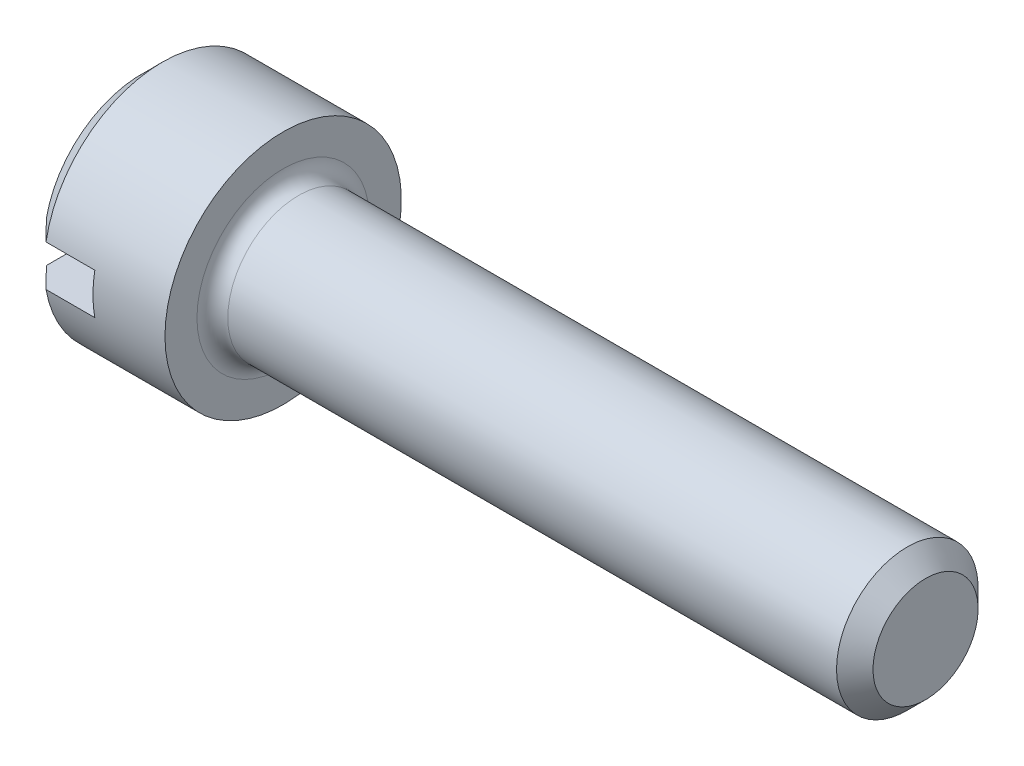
ISO-10303-21;
HEADER;
FILE_DESCRIPTION(('STEP AP214'),'2;1');
FILE_NAME('part.step','',(''),(''),'','','');
FILE_SCHEMA(('AUTOMOTIVE_DESIGN { 1 0 10303 214 1 1 1 1 }'));
ENDSEC;
DATA;
#1=APPLICATION_CONTEXT('core data for automotive mechanical design processes');
#2=APPLICATION_PROTOCOL_DEFINITION('international standard','automotive_design',2000,#1);
#3=PRODUCT_CONTEXT('',#1,'mechanical');
#4=PRODUCT('Part','Part','',(#3));
#5=PRODUCT_RELATED_PRODUCT_CATEGORY('part','',(#4));
#6=PRODUCT_DEFINITION_FORMATION('','',#4);
#7=PRODUCT_DEFINITION_CONTEXT('part definition',#1,'design');
#8=PRODUCT_DEFINITION('design','',#6,#7);
#9=PRODUCT_DEFINITION_SHAPE('','',#8);
#10=(LENGTH_UNIT() NAMED_UNIT(*) SI_UNIT(.MILLI.,.METRE.));
#11=(NAMED_UNIT(*) PLANE_ANGLE_UNIT() SI_UNIT($,.RADIAN.));
#12=(NAMED_UNIT(*) SI_UNIT($,.STERADIAN.) SOLID_ANGLE_UNIT());
#13=UNCERTAINTY_MEASURE_WITH_UNIT(LENGTH_MEASURE(1.E-05),#10,'distance_accuracy_value','');
#14=(GEOMETRIC_REPRESENTATION_CONTEXT(3) GLOBAL_UNCERTAINTY_ASSIGNED_CONTEXT((#13)) GLOBAL_UNIT_ASSIGNED_CONTEXT((#10,
#11,#12)) REPRESENTATION_CONTEXT('',''));
#15=CARTESIAN_POINT('',(0.,0.,0.));
#16=DIRECTION('',(0.,0.,1.));
#17=DIRECTION('',(1.,0.,0.));
#18=AXIS2_PLACEMENT_3D('',#15,#16,#17);
#19=CARTESIAN_POINT('',(-25.4,0.,0.));
#20=DIRECTION('',(-1.,0.,0.));
#21=DIRECTION('',(0.,0.,1.));
#22=AXIS2_PLACEMENT_3D('',#19,#20,#21);
#23=CYLINDRICAL_SURFACE('',#22,1.1684);
#24=CARTESIAN_POINT('',(1.397,0.,0.));
#25=DIRECTION('',(-1.,0.,0.));
#26=DIRECTION('',(0.,0.,1.));
#27=AXIS2_PLACEMENT_3D('',#24,#25,#26);
#28=CIRCLE('',#27,1.1684);
#29=CARTESIAN_POINT('',(1.397,0.,1.1684));
#30=VERTEX_POINT('',#29);
#31=EDGE_CURVE('E146',#30,#30,#28,.T.);
#32=ORIENTED_EDGE('',*,*,#31,.T.);
#33=EDGE_LOOP('',(#32));
#34=FACE_BOUND('',#33,.T.);
#35=CARTESIAN_POINT('',(0.203200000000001,0.,0.));
#36=DIRECTION('',(-1.,0.,0.));
#37=DIRECTION('',(0.,0.,1.));
#38=AXIS2_PLACEMENT_3D('',#35,#36,#37);
#39=CIRCLE('',#38,1.1684);
#40=CARTESIAN_POINT('',(0.203200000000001,-0.2032,-1.15059476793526));
#41=VERTEX_POINT('',#40);
#42=CARTESIAN_POINT('',(0.203200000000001,-0.2032,1.15059476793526));
#43=VERTEX_POINT('',#42);
#44=EDGE_CURVE('E147',#41,#43,#39,.T.);
#45=ORIENTED_EDGE('',*,*,#44,.F.);
#46=DIRECTION('',(-1.,0.,0.));
#47=VECTOR('',#46,1.);
#48=CARTESIAN_POINT('',(-25.4,-0.2032,-1.15059476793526));
#49=LINE('',#48,#47);
#50=CARTESIAN_POINT('',(0.6858,-0.2032,-1.15059476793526));
#51=VERTEX_POINT('',#50);
#52=EDGE_CURVE('E55',#41,#51,#49,.F.);
#53=ORIENTED_EDGE('',*,*,#52,.T.);
#54=CARTESIAN_POINT('',(0.6858,0.,0.));
#55=DIRECTION('',(-1.,0.,0.));
#56=DIRECTION('',(0.,0.,1.));
#57=AXIS2_PLACEMENT_3D('',#54,#55,#56);
#58=CIRCLE('',#57,1.1684);
#59=CARTESIAN_POINT('',(0.6858,0.2032,-1.15059476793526));
#60=VERTEX_POINT('',#59);
#61=EDGE_CURVE('E96',#51,#60,#58,.F.);
#62=ORIENTED_EDGE('',*,*,#61,.T.);
#63=DIRECTION('',(-1.,0.,0.));
#64=VECTOR('',#63,1.);
#65=CARTESIAN_POINT('',(-25.4,0.2032,-1.15059476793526));
#66=LINE('',#65,#64);
#67=CARTESIAN_POINT('',(0.203200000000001,0.2032,-1.15059476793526));
#68=VERTEX_POINT('',#67);
#69=EDGE_CURVE('E102',#60,#68,#66,.T.);
#70=ORIENTED_EDGE('',*,*,#69,.T.);
#71=CARTESIAN_POINT('',(0.203200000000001,0.2032,1.15059476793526));
#72=VERTEX_POINT('',#71);
#73=EDGE_CURVE('E107',#72,#68,#39,.T.);
#74=ORIENTED_EDGE('',*,*,#73,.F.);
#75=DIRECTION('',(-1.,0.,0.));
#76=VECTOR('',#75,1.);
#77=CARTESIAN_POINT('',(-25.4,0.2032,1.15059476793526));
#78=LINE('',#77,#76);
#79=CARTESIAN_POINT('',(0.6858,0.2032,1.15059476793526));
#80=VERTEX_POINT('',#79);
#81=EDGE_CURVE('E100',#72,#80,#78,.F.);
#82=ORIENTED_EDGE('',*,*,#81,.T.);
#83=CARTESIAN_POINT('',(0.6858,-0.2032,1.15059476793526));
#84=VERTEX_POINT('',#83);
#85=EDGE_CURVE('E86',#80,#84,#58,.F.);
#86=ORIENTED_EDGE('',*,*,#85,.T.);
#87=DIRECTION('',(-1.,0.,0.));
#88=VECTOR('',#87,1.);
#89=CARTESIAN_POINT('',(-25.4,-0.2032,1.15059476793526));
#90=LINE('',#89,#88);
#91=EDGE_CURVE('E110',#84,#43,#90,.T.);
#92=ORIENTED_EDGE('',*,*,#91,.T.);
#93=EDGE_LOOP('',(#45,#53,#62,#70,#74,#82,#86,#92));
#94=FACE_BOUND('',#93,.T.);
#95=ADVANCED_FACE('F32',(#34,#94),#23,.T.);
#96=CARTESIAN_POINT('',(0.203200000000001,0.,0.));
#97=DIRECTION('',(1.,0.,0.));
#98=DIRECTION('',(0.,0.,-1.));
#99=AXIS2_PLACEMENT_3D('',#96,#97,#98);
#100=CONICAL_SURFACE('',#99,1.1684,0.785398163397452);
#101=CARTESIAN_POINT('',(1.61077088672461,-0.2032,-2.56794387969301));
#102=CARTESIAN_POINT('',(1.5197908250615,-0.2032,-2.47667680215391));
#103=CARTESIAN_POINT('',(1.42882343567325,-0.2032,-2.38539707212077));
#104=CARTESIAN_POINT('',(1.24692776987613,-0.2032,-2.20279080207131));
#105=CARTESIAN_POINT('',(1.15599949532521,-0.2032,-2.1114642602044));
#106=CARTESIAN_POINT('',(0.974109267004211,-0.2032,-1.92865584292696));
#107=CARTESIAN_POINT('',(0.883147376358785,-0.2032,-1.83717390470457));
#108=CARTESIAN_POINT('',(0.701321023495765,-0.2032,-1.65412082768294));
#109=CARTESIAN_POINT('',(0.610456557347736,-0.2032,-1.56254969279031));
#110=CARTESIAN_POINT('',(0.433381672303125,-0.2032,-1.38379254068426));
#111=CARTESIAN_POINT('',(0.34716368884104,-0.2032,-1.29661401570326));
#112=CARTESIAN_POINT('',(0.174961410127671,-0.2032,-1.12200509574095));
#113=CARTESIAN_POINT('',(0.0889771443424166,-0.2032,-1.03457467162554));
#114=CARTESIAN_POINT('',(-0.0395861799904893,-0.2032,-0.903079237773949));
#115=CARTESIAN_POINT('',(-0.0823583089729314,-0.2032,-0.859203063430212));
#116=CARTESIAN_POINT('',(-0.167701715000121,-0.2032,-0.771251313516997));
#117=CARTESIAN_POINT('',(-0.210272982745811,-0.2032,-0.727175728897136));
#118=CARTESIAN_POINT('',(-0.295065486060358,-0.2032,-0.638708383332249));
#119=CARTESIAN_POINT('',(-0.337286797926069,-0.2032,-0.594316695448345));
#120=CARTESIAN_POINT('',(-0.421118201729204,-0.2032,-0.504960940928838));
#121=CARTESIAN_POINT('',(-0.462728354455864,-0.2032,-0.459996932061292));
#122=CARTESIAN_POINT('',(-0.515039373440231,-0.2032,-0.401726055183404));
#123=CARTESIAN_POINT('',(-0.526375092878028,-0.2032,-0.388991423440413));
#124=CARTESIAN_POINT('',(-0.548899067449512,-0.2032,-0.363390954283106));
#125=CARTESIAN_POINT('',(-0.560087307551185,-0.2032,-0.350525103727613));
#126=CARTESIAN_POINT('',(-0.593553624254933,-0.2032,-0.311475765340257));
#127=CARTESIAN_POINT('',(-0.615549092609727,-0.2032,-0.285043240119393));
#128=CARTESIAN_POINT('',(-0.647498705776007,-0.2032,-0.244362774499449));
#129=CARTESIAN_POINT('',(-0.658021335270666,-0.2032,-0.230563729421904));
#130=CARTESIAN_POINT('',(-0.678466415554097,-0.2032,-0.202530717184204));
#131=CARTESIAN_POINT('',(-0.688389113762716,-0.2032,-0.188296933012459));
#132=CARTESIAN_POINT('',(-0.707228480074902,-0.2032,-0.159310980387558));
#133=CARTESIAN_POINT('',(-0.716151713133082,-0.2032,-0.144563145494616));
#134=CARTESIAN_POINT('',(-0.732436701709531,-0.2032,-0.114244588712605));
#135=CARTESIAN_POINT('',(-0.739802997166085,-0.2032,-0.0986764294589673));
#136=CARTESIAN_POINT('',(-0.750441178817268,-0.2032,-0.0704091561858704));
#137=CARTESIAN_POINT('',(-0.754272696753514,-0.2032,-0.0579291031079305));
#138=CARTESIAN_POINT('',(-0.759782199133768,-0.2032,-0.0325269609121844));
#139=CARTESIAN_POINT('',(-0.761469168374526,-0.2032,-0.019606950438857));
#140=CARTESIAN_POINT('',(-0.762316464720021,-0.2032,0.00640529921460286));
#141=CARTESIAN_POINT('',(-0.761460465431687,-0.2032,0.0194981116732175));
#142=CARTESIAN_POINT('',(-0.757401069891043,-0.2032,0.0453321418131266));
#143=CARTESIAN_POINT('',(-0.75418993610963,-0.2032,0.0580720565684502));
#144=CARTESIAN_POINT('',(-0.746047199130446,-0.2032,0.0829213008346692));
#145=CARTESIAN_POINT('',(-0.74112027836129,-0.2032,0.0950322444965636));
#146=CARTESIAN_POINT('',(-0.73009553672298,-0.2032,0.118717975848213));
#147=CARTESIAN_POINT('',(-0.723995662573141,-0.2032,0.130291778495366));
#148=CARTESIAN_POINT('',(-0.710964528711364,-0.2032,0.15308015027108));
#149=CARTESIAN_POINT('',(-0.704026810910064,-0.2032,0.164290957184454));
#150=CARTESIAN_POINT('',(-0.689616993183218,-0.2032,0.186345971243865));
#151=CARTESIAN_POINT('',(-0.682145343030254,-0.2032,0.197190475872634));
#152=CARTESIAN_POINT('',(-0.657862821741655,-0.2032,0.231158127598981));
#153=CARTESIAN_POINT('',(-0.640363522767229,-0.2032,0.25378533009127));
#154=CARTESIAN_POINT('',(-0.604477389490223,-0.2032,0.298329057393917));
#155=CARTESIAN_POINT('',(-0.586089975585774,-0.2032,0.320245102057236));
#156=CARTESIAN_POINT('',(-0.54876363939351,-0.2032,0.363665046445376));
#157=CARTESIAN_POINT('',(-0.529823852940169,-0.2032,0.385168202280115));
#158=CARTESIAN_POINT('',(-0.491615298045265,-0.2032,0.427880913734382));
#159=CARTESIAN_POINT('',(-0.472346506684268,-0.2032,0.449090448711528));
#160=CARTESIAN_POINT('',(-0.414343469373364,-0.2032,0.512285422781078));
#161=CARTESIAN_POINT('',(-0.375289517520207,-0.2032,0.553976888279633));
#162=CARTESIAN_POINT('',(-0.29679433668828,-0.2032,0.636904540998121));
#163=CARTESIAN_POINT('',(-0.257353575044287,-0.2032,0.678141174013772));
#164=CARTESIAN_POINT('',(-0.142515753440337,-0.2032,0.797486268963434));
#165=CARTESIAN_POINT('',(-0.0667944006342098,-0.2032,0.8752824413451));
#166=CARTESIAN_POINT('',(0.0850297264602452,-0.2032,1.03050313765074));
#167=CARTESIAN_POINT('',(0.161132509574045,-0.2032,1.10792765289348));
#168=CARTESIAN_POINT('',(0.313589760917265,-0.2032,1.26261072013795));
#169=CARTESIAN_POINT('',(0.389944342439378,-0.2032,1.3398691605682));
#170=CARTESIAN_POINT('',(0.542776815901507,-0.2032,1.49426241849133));
#171=CARTESIAN_POINT('',(0.619254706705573,-0.2032,1.57139723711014));
#172=CARTESIAN_POINT('',(0.848107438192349,-0.2032,1.80198786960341));
#173=CARTESIAN_POINT('',(1.00059511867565,-0.2032,1.95533167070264));
#174=CARTESIAN_POINT('',(1.30564206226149,-0.2032,2.26176848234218));
#175=CARTESIAN_POINT('',(1.45820123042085,-0.2032,2.41486158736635));
#176=CARTESIAN_POINT('',(1.61077088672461,-0.2032,2.56794387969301));
#177=B_SPLINE_CURVE_WITH_KNOTS('',3,(#101,#102,#103,#104,#105,#106,#107,#108,#109,#110,#111,
#112,#113,#114,#115,#116,#117,#118,#119,#120,#121,#122,#123,#124,#125,#126,#127,#128,#129,#130,
#131,#132,#133,#134,#135,#136,#137,#138,#139,#140,#141,#142,#143,#144,#145,#146,#147,#148,#149,
#150,#151,#152,#153,#154,#155,#156,#157,#158,#159,#160,#161,#162,#163,#164,#165,#166,#167,#168,
#169,#170,#171,#172,#173,#174,#175,#176),.UNSPECIFIED.,.F.,.F.,(4,2,2,2,2,2,2,2,2,2,2,2,2,2,2,2,
2,2,2,2,2,2,2,2,2,2,2,2,2,2,2,2,2,2,2,2,2,4),(0.,0.386605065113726,0.773226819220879,
1.16025016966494,1.54725726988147,1.91509236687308,2.28297186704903,2.46679533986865,
2.65062724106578,2.83441794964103,3.01819025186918,3.06933601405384,3.12048694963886,
3.22361054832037,3.27566116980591,3.32769017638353,3.37935444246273,3.43086591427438,
3.46989356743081,3.50875716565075,3.54787081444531,3.58711354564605,3.6262500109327,
3.66545561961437,3.7049854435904,3.74448235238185,3.83024159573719,3.91605758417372,
4.00201590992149,4.08798024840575,4.25935066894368,4.4305347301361,4.75621978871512,
5.08191241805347,5.4077801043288,5.73364480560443,6.38241366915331,7.03080071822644),.UNSPECIFIED.);
#178=CARTESIAN_POINT('',(0.,-0.2032,-0.943568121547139));
#179=VERTEX_POINT('',#178);
#180=EDGE_CURVE('E112',#41,#179,#177,.T.);
#181=ORIENTED_EDGE('',*,*,#180,.F.);
#182=ORIENTED_EDGE('',*,*,#44,.T.);
#183=CARTESIAN_POINT('',(0.,-0.2032,0.943568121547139));
#184=VERTEX_POINT('',#183);
#185=EDGE_CURVE('E108',#184,#43,#177,.T.);
#186=ORIENTED_EDGE('',*,*,#185,.F.);
#187=CARTESIAN_POINT('',(0.,0.,0.));
#188=DIRECTION('',(-1.,0.,0.));
#189=DIRECTION('',(0.,0.,1.));
#190=AXIS2_PLACEMENT_3D('',#187,#188,#189);
#191=CIRCLE('',#190,0.965199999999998);
#192=EDGE_CURVE('E197',#179,#184,#191,.T.);
#193=ORIENTED_EDGE('',*,*,#192,.F.);
#194=EDGE_LOOP('',(#181,#182,#186,#193));
#195=FACE_BOUND('',#194,.T.);
#196=ADVANCED_FACE('F123',(#195),#100,.T.);
#197=CARTESIAN_POINT('',(1.61077088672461,0.2032,2.56794387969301));
#198=CARTESIAN_POINT('',(1.5197908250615,0.2032,2.47667680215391));
#199=CARTESIAN_POINT('',(1.42882343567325,0.2032,2.38539707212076));
#200=CARTESIAN_POINT('',(1.24692776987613,0.2032,2.20279080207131));
#201=CARTESIAN_POINT('',(1.15599949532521,0.2032,2.1114642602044));
#202=CARTESIAN_POINT('',(0.97410926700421,0.2032,1.92865584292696));
#203=CARTESIAN_POINT('',(0.883147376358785,0.2032,1.83717390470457));
#204=CARTESIAN_POINT('',(0.701321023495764,0.2032,1.65412082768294));
#205=CARTESIAN_POINT('',(0.610456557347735,0.2032,1.5625496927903));
#206=CARTESIAN_POINT('',(0.433381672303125,0.2032,1.38379254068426));
#207=CARTESIAN_POINT('',(0.34716368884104,0.2032,1.29661401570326));
#208=CARTESIAN_POINT('',(0.174961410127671,0.2032,1.12200509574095));
#209=CARTESIAN_POINT('',(0.0889771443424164,0.2032,1.03457467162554));
#210=CARTESIAN_POINT('',(-0.0395861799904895,0.2032,0.903079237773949));
#211=CARTESIAN_POINT('',(-0.0823583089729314,0.2032,0.859203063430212));
#212=CARTESIAN_POINT('',(-0.167701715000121,0.2032,0.771251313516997));
#213=CARTESIAN_POINT('',(-0.210272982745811,0.2032,0.727175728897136));
#214=CARTESIAN_POINT('',(-0.295065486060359,0.2032,0.638708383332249));
#215=CARTESIAN_POINT('',(-0.337286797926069,0.2032,0.594316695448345));
#216=CARTESIAN_POINT('',(-0.421118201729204,0.2032,0.504960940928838));
#217=CARTESIAN_POINT('',(-0.462728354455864,0.2032,0.459996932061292));
#218=CARTESIAN_POINT('',(-0.515039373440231,0.2032,0.401726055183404));
#219=CARTESIAN_POINT('',(-0.526375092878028,0.2032,0.388991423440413));
#220=CARTESIAN_POINT('',(-0.548899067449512,0.2032,0.363390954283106));
#221=CARTESIAN_POINT('',(-0.560087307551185,0.2032,0.350525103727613));
#222=CARTESIAN_POINT('',(-0.593553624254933,0.2032,0.311475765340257));
#223=CARTESIAN_POINT('',(-0.615549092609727,0.2032,0.285043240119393));
#224=CARTESIAN_POINT('',(-0.647498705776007,0.2032,0.244362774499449));
#225=CARTESIAN_POINT('',(-0.658021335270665,0.2032,0.230563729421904));
#226=CARTESIAN_POINT('',(-0.678466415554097,0.2032,0.202530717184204));
#227=CARTESIAN_POINT('',(-0.688389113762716,0.2032,0.188296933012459));
#228=CARTESIAN_POINT('',(-0.707228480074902,0.2032,0.159310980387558));
#229=CARTESIAN_POINT('',(-0.716151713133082,0.2032,0.144563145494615));
#230=CARTESIAN_POINT('',(-0.732436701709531,0.2032,0.114244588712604));
#231=CARTESIAN_POINT('',(-0.739802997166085,0.2032,0.098676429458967));
#232=CARTESIAN_POINT('',(-0.750441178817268,0.2032,0.0704091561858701));
#233=CARTESIAN_POINT('',(-0.754272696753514,0.2032,0.0579291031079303));
#234=CARTESIAN_POINT('',(-0.759782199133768,0.2032,0.0325269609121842));
#235=CARTESIAN_POINT('',(-0.761469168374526,0.2032,0.0196069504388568));
#236=CARTESIAN_POINT('',(-0.762316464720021,0.2032,-0.00640529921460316));
#237=CARTESIAN_POINT('',(-0.761460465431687,0.2032,-0.0194981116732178));
#238=CARTESIAN_POINT('',(-0.757401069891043,0.2032,-0.0453321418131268));
#239=CARTESIAN_POINT('',(-0.754189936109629,0.2032,-0.0580720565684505));
#240=CARTESIAN_POINT('',(-0.746047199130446,0.2032,-0.0829213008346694));
#241=CARTESIAN_POINT('',(-0.741120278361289,0.2032,-0.0950322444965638));
#242=CARTESIAN_POINT('',(-0.73009553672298,0.2032,-0.118717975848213));
#243=CARTESIAN_POINT('',(-0.723995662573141,0.2032,-0.130291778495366));
#244=CARTESIAN_POINT('',(-0.710964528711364,0.2032,-0.15308015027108));
#245=CARTESIAN_POINT('',(-0.704026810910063,0.2032,-0.164290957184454));
#246=CARTESIAN_POINT('',(-0.689616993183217,0.2032,-0.186345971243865));
#247=CARTESIAN_POINT('',(-0.682145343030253,0.2032,-0.197190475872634));
#248=CARTESIAN_POINT('',(-0.657862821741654,0.2032,-0.231158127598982));
#249=CARTESIAN_POINT('',(-0.640363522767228,0.2032,-0.25378533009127));
#250=CARTESIAN_POINT('',(-0.604477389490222,0.2032,-0.298329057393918));
#251=CARTESIAN_POINT('',(-0.586089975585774,0.2032,-0.320245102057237));
#252=CARTESIAN_POINT('',(-0.548763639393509,0.2032,-0.363665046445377));
#253=CARTESIAN_POINT('',(-0.529823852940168,0.2032,-0.385168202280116));
#254=CARTESIAN_POINT('',(-0.491615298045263,0.2032,-0.427880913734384));
#255=CARTESIAN_POINT('',(-0.472346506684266,0.2032,-0.44909044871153));
#256=CARTESIAN_POINT('',(-0.414343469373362,0.2032,-0.51228542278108));
#257=CARTESIAN_POINT('',(-0.375289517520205,0.2032,-0.553976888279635));
#258=CARTESIAN_POINT('',(-0.296794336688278,0.2032,-0.636904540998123));
#259=CARTESIAN_POINT('',(-0.257353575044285,0.2032,-0.678141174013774));
#260=CARTESIAN_POINT('',(-0.142515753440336,0.2032,-0.797486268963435));
#261=CARTESIAN_POINT('',(-0.0667944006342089,0.2032,-0.875282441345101));
#262=CARTESIAN_POINT('',(0.0850297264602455,0.2032,-1.03050313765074));
#263=CARTESIAN_POINT('',(0.161132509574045,0.2032,-1.10792765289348));
#264=CARTESIAN_POINT('',(0.313589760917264,0.2032,-1.26261072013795));
#265=CARTESIAN_POINT('',(0.389944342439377,0.2032,-1.33986916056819));
#266=CARTESIAN_POINT('',(0.542776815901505,0.2032,-1.49426241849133));
#267=CARTESIAN_POINT('',(0.619254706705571,0.2032,-1.57139723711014));
#268=CARTESIAN_POINT('',(0.848107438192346,0.2032,-1.80198786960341));
#269=CARTESIAN_POINT('',(1.00059511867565,0.2032,-1.95533167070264));
#270=CARTESIAN_POINT('',(1.30564206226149,0.2032,-2.26176848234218));
#271=CARTESIAN_POINT('',(1.45820123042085,0.2032,-2.41486158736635));
#272=CARTESIAN_POINT('',(1.61077088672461,0.2032,-2.56794387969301));
#273=B_SPLINE_CURVE_WITH_KNOTS('',3,(#197,#198,#199,#200,#201,#202,#203,#204,#205,#206,#207,
#208,#209,#210,#211,#212,#213,#214,#215,#216,#217,#218,#219,#220,#221,#222,#223,#224,#225,#226,
#227,#228,#229,#230,#231,#232,#233,#234,#235,#236,#237,#238,#239,#240,#241,#242,#243,#244,#245,
#246,#247,#248,#249,#250,#251,#252,#253,#254,#255,#256,#257,#258,#259,#260,#261,#262,#263,#264,
#265,#266,#267,#268,#269,#270,#271,#272),.UNSPECIFIED.,.F.,.F.,(4,2,2,2,2,2,2,2,2,2,2,2,2,2,2,2,
2,2,2,2,2,2,2,2,2,2,2,2,2,2,2,2,2,2,2,2,2,4),(0.,0.386605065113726,0.773226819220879,
1.16025016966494,1.54725726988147,1.91509236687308,2.28297186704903,2.46679533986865,
2.65062724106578,2.83441794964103,3.01819025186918,3.06933601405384,3.12048694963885,
3.22361054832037,3.27566116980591,3.32769017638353,3.37935444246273,3.43086591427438,
3.46989356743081,3.50875716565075,3.54787081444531,3.58711354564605,3.6262500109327,
3.66545561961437,3.70498544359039,3.74448235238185,3.83024159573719,3.91605758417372,
4.00201590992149,4.08798024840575,4.25935066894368,4.4305347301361,4.75621978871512,
5.08191241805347,5.4077801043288,5.73364480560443,6.3824136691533,7.03080071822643),.UNSPECIFIED.);
#274=CARTESIAN_POINT('',(0.,0.2032,0.943568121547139));
#275=VERTEX_POINT('',#274);
#276=EDGE_CURVE('E47',#72,#275,#273,.T.);
#277=ORIENTED_EDGE('',*,*,#276,.F.);
#278=ORIENTED_EDGE('',*,*,#73,.T.);
#279=CARTESIAN_POINT('',(0.,0.2032,-0.943568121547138));
#280=VERTEX_POINT('',#279);
#281=EDGE_CURVE('E114',#280,#68,#273,.T.);
#282=ORIENTED_EDGE('',*,*,#281,.F.);
#283=EDGE_CURVE('E153',#275,#280,#191,.T.);
#284=ORIENTED_EDGE('',*,*,#283,.F.);
#285=EDGE_LOOP('',(#277,#278,#282,#284));
#286=FACE_BOUND('',#285,.T.);
#287=ADVANCED_FACE('F143',(#286),#100,.T.);
#288=CARTESIAN_POINT('',(0.,0.,0.));
#289=DIRECTION('',(-1.,0.,0.));
#290=DIRECTION('',(0.,0.,1.));
#291=AXIS2_PLACEMENT_3D('',#288,#289,#290);
#292=PLANE('',#291);
#293=ORIENTED_EDGE('',*,*,#192,.T.);
#294=DIRECTION('',(0.,0.,-1.));
#295=VECTOR('',#294,1.);
#296=CARTESIAN_POINT('',(0.,-0.2032,0.));
#297=LINE('',#296,#295);
#298=EDGE_CURVE('E97',#184,#179,#297,.T.);
#299=ORIENTED_EDGE('',*,*,#298,.T.);
#300=EDGE_LOOP('',(#293,#299));
#301=FACE_BOUND('',#300,.T.);
#302=ADVANCED_FACE('F187',(#301),#292,.T.);
#303=ORIENTED_EDGE('',*,*,#283,.T.);
#304=DIRECTION('',(0.,0.,1.));
#305=VECTOR('',#304,1.);
#306=CARTESIAN_POINT('',(0.,0.2032,0.));
#307=LINE('',#306,#305);
#308=EDGE_CURVE('E150',#280,#275,#307,.T.);
#309=ORIENTED_EDGE('',*,*,#308,.T.);
#310=EDGE_LOOP('',(#303,#309));
#311=FACE_BOUND('',#310,.T.);
#312=ADVANCED_FACE('F182',(#311),#292,.T.);
#313=CARTESIAN_POINT('',(-25.4,0.,0.));
#314=DIRECTION('',(-1.,0.,0.));
#315=DIRECTION('',(0.,0.,1.));
#316=AXIS2_PLACEMENT_3D('',#313,#314,#315);
#317=CYLINDRICAL_SURFACE('',#316,0.69977);
#318=CARTESIAN_POINT('',(1.5494,0.,0.));
#319=DIRECTION('',(-1.,0.,0.));
#320=DIRECTION('',(0.,0.,1.));
#321=AXIS2_PLACEMENT_3D('',#318,#319,#320);
#322=CIRCLE('',#321,0.69977);
#323=CARTESIAN_POINT('',(1.5494,0.,0.69977));
#324=VERTEX_POINT('',#323);
#325=EDGE_CURVE('E11',#324,#324,#322,.F.);
#326=ORIENTED_EDGE('',*,*,#325,.T.);
#327=EDGE_LOOP('',(#326));
#328=FACE_BOUND('',#327,.T.);
#329=CARTESIAN_POINT('',(7.56666,0.,0.));
#330=DIRECTION('',(-1.,0.,0.));
#331=DIRECTION('',(0.,0.,1.));
#332=AXIS2_PLACEMENT_3D('',#329,#330,#331);
#333=CIRCLE('',#332,0.69977);
#334=CARTESIAN_POINT('',(7.56666,0.,0.69977));
#335=VERTEX_POINT('',#334);
#336=EDGE_CURVE('E192',#335,#335,#333,.T.);
#337=ORIENTED_EDGE('',*,*,#336,.T.);
#338=EDGE_LOOP('',(#337));
#339=FACE_BOUND('',#338,.T.);
#340=ADVANCED_FACE('F180',(#328,#339),#317,.T.);
#341=CARTESIAN_POINT('',(1.397,0.69977,0.));
#342=DIRECTION('',(-1.,0.,0.));
#343=DIRECTION('',(0.,0.,1.));
#344=AXIS2_PLACEMENT_3D('',#341,#342,#343);
#345=PLANE('',#344);
#346=CARTESIAN_POINT('',(1.397,0.,0.));
#347=DIRECTION('',(-1.,0.,0.));
#348=DIRECTION('',(0.,0.,1.));
#349=AXIS2_PLACEMENT_3D('',#346,#347,#348);
#350=CIRCLE('',#349,0.85217);
#351=CARTESIAN_POINT('',(1.397,0.,0.85217));
#352=VERTEX_POINT('',#351);
#353=EDGE_CURVE('E40',#352,#352,#350,.T.);
#354=ORIENTED_EDGE('',*,*,#353,.T.);
#355=EDGE_LOOP('',(#354));
#356=FACE_BOUND('',#355,.T.);
#357=ORIENTED_EDGE('',*,*,#31,.F.);
#358=EDGE_LOOP('',(#357));
#359=FACE_BOUND('',#358,.T.);
#360=ADVANCED_FACE('F162',(#356,#359),#345,.F.);
#361=CARTESIAN_POINT('',(7.747,0.51943,0.));
#362=DIRECTION('',(1.,0.,0.));
#363=DIRECTION('',(0.,0.,-1.));
#364=AXIS2_PLACEMENT_3D('',#361,#362,#363);
#365=PLANE('',#364);
#366=CARTESIAN_POINT('',(7.747,0.,0.));
#367=DIRECTION('',(-1.,0.,0.));
#368=DIRECTION('',(0.,0.,1.));
#369=AXIS2_PLACEMENT_3D('',#366,#367,#368);
#370=CIRCLE('',#369,0.51943);
#371=CARTESIAN_POINT('',(7.747,0.,0.51943));
#372=VERTEX_POINT('',#371);
#373=EDGE_CURVE('E194',#372,#372,#370,.T.);
#374=ORIENTED_EDGE('',*,*,#373,.F.);
#375=EDGE_LOOP('',(#374));
#376=FACE_BOUND('',#375,.T.);
#377=ADVANCED_FACE('F179',(#376),#365,.T.);
#378=CARTESIAN_POINT('',(7.56666,0.,0.));
#379=DIRECTION('',(-1.,0.,0.));
#380=DIRECTION('',(0.,0.,1.));
#381=AXIS2_PLACEMENT_3D('',#378,#379,#380);
#382=CONICAL_SURFACE('',#381,0.69977,0.785398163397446);
#383=ORIENTED_EDGE('',*,*,#373,.T.);
#384=EDGE_LOOP('',(#383));
#385=FACE_BOUND('',#384,.T.);
#386=ORIENTED_EDGE('',*,*,#336,.F.);
#387=EDGE_LOOP('',(#386));
#388=FACE_BOUND('',#387,.T.);
#389=ADVANCED_FACE('F132',(#385,#388),#382,.T.);
#390=CARTESIAN_POINT('',(0.,-0.2032,-1.1684));
#391=DIRECTION('',(0.,1.,0.));
#392=DIRECTION('',(0.,0.,1.));
#393=AXIS2_PLACEMENT_3D('',#390,#391,#392);
#394=PLANE('',#393);
#395=ORIENTED_EDGE('',*,*,#180,.T.);
#396=ORIENTED_EDGE('',*,*,#298,.F.);
#397=ORIENTED_EDGE('',*,*,#185,.T.);
#398=ORIENTED_EDGE('',*,*,#91,.F.);
#399=DIRECTION('',(0.,0.,1.));
#400=VECTOR('',#399,1.);
#401=CARTESIAN_POINT('',(0.6858,-0.2032,-1.1684));
#402=LINE('',#401,#400);
#403=EDGE_CURVE('E91',#51,#84,#402,.T.);
#404=ORIENTED_EDGE('',*,*,#403,.F.);
#405=ORIENTED_EDGE('',*,*,#52,.F.);
#406=EDGE_LOOP('',(#395,#396,#397,#398,#404,#405));
#407=FACE_BOUND('',#406,.T.);
#408=ADVANCED_FACE('F127',(#407),#394,.T.);
#409=CARTESIAN_POINT('',(0.,0.2032,1.1684));
#410=DIRECTION('',(0.,-1.,0.));
#411=DIRECTION('',(0.,0.,-1.));
#412=AXIS2_PLACEMENT_3D('',#409,#410,#411);
#413=PLANE('',#412);
#414=ORIENTED_EDGE('',*,*,#276,.T.);
#415=ORIENTED_EDGE('',*,*,#308,.F.);
#416=ORIENTED_EDGE('',*,*,#281,.T.);
#417=ORIENTED_EDGE('',*,*,#69,.F.);
#418=DIRECTION('',(0.,0.,-1.));
#419=VECTOR('',#418,1.);
#420=CARTESIAN_POINT('',(0.6858,0.2032,1.1684));
#421=LINE('',#420,#419);
#422=EDGE_CURVE('E89',#80,#60,#421,.T.);
#423=ORIENTED_EDGE('',*,*,#422,.F.);
#424=ORIENTED_EDGE('',*,*,#81,.F.);
#425=EDGE_LOOP('',(#414,#415,#416,#417,#423,#424));
#426=FACE_BOUND('',#425,.T.);
#427=ADVANCED_FACE('F99',(#426),#413,.T.);
#428=CARTESIAN_POINT('',(0.6858,0.2032,-1.1684));
#429=DIRECTION('',(-1.,0.,0.));
#430=DIRECTION('',(0.,0.,1.));
#431=AXIS2_PLACEMENT_3D('',#428,#429,#430);
#432=PLANE('',#431);
#433=ORIENTED_EDGE('',*,*,#403,.T.);
#434=ORIENTED_EDGE('',*,*,#85,.F.);
#435=ORIENTED_EDGE('',*,*,#422,.T.);
#436=ORIENTED_EDGE('',*,*,#61,.F.);
#437=EDGE_LOOP('',(#433,#434,#435,#436));
#438=FACE_BOUND('',#437,.T.);
#439=ADVANCED_FACE('F88',(#438),#432,.T.);
#440=CARTESIAN_POINT('',(1.5494,0.,0.));
#441=DIRECTION('',(-1.,0.,0.));
#442=DIRECTION('',(0.,0.,1.));
#443=AXIS2_PLACEMENT_3D('',#440,#441,#442);
#444=TOROIDAL_SURFACE('',#443,0.85217,0.1524);
#445=ORIENTED_EDGE('',*,*,#325,.F.);
#446=EDGE_LOOP('',(#445));
#447=FACE_BOUND('',#446,.T.);
#448=ORIENTED_EDGE('',*,*,#353,.F.);
#449=EDGE_LOOP('',(#448));
#450=FACE_BOUND('',#449,.T.);
#451=ADVANCED_FACE('F34',(#447,#450),#444,.F.);
#452=CLOSED_SHELL('',(#95,#196,#287,#302,#312,#340,#360,#377,#389,#408,#427,#439,#451));
#453=MANIFOLD_SOLID_BREP('B2',#452);
#454=ADVANCED_BREP_SHAPE_REPRESENTATION('',(#18,#453),#14);
#455=SHAPE_DEFINITION_REPRESENTATION(#9,#454);
ENDSEC;
END-ISO-10303-21;
